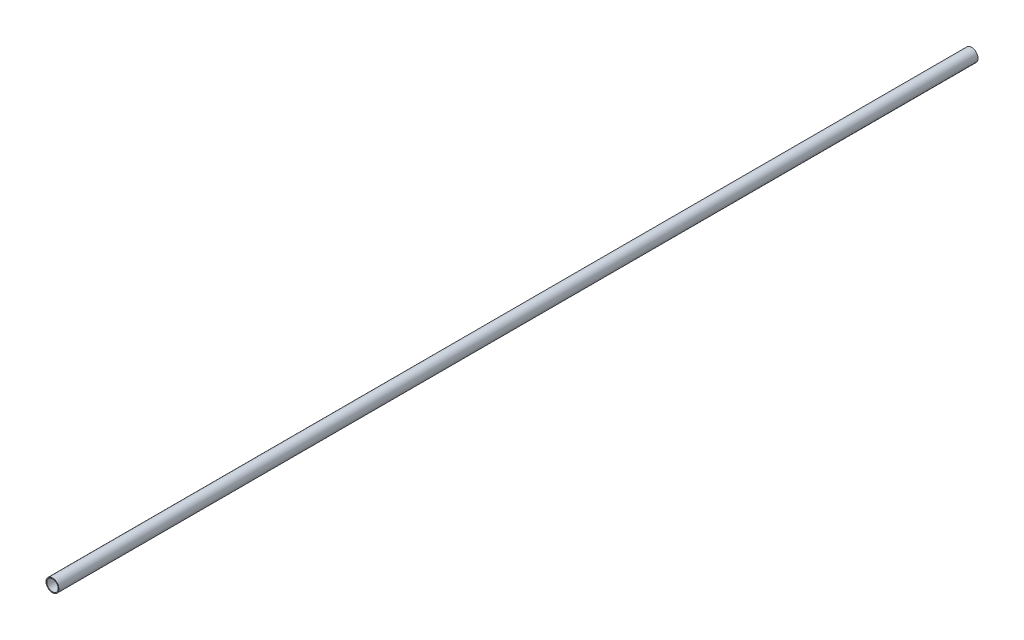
from build123d import *

# Parameters (mm, degrees)
ESQUISSE1_R      = 0.4
ESQUISSE1_R_2    = 0.35
EXTRUSION1_DEPTH = 57


with BuildPart() as part:
    # Esquisse1 → Extrusion1 (new body)
    with BuildSketch(Plane.XY):
        Circle(ESQUISSE1_R)
        Circle(ESQUISSE1_R_2, mode=Mode.SUBTRACT)
    extrude(amount=EXTRUSION1_DEPTH)


solid = part.part
